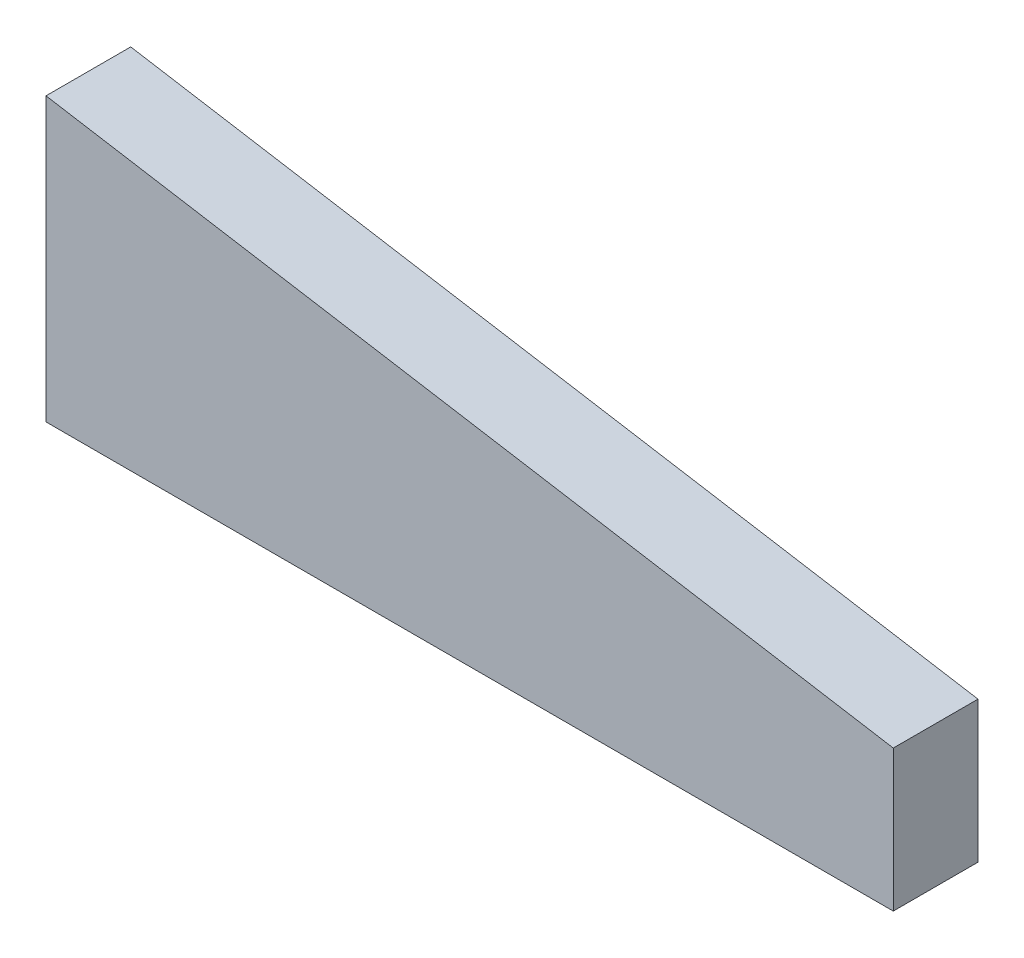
ISO-10303-21;
HEADER;
FILE_DESCRIPTION(('STEP AP214'),'2;1');
FILE_NAME('part.step','',(''),(''),'','','');
FILE_SCHEMA(('AUTOMOTIVE_DESIGN { 1 0 10303 214 1 1 1 1 }'));
ENDSEC;
DATA;
#1=APPLICATION_CONTEXT('core data for automotive mechanical design processes');
#2=APPLICATION_PROTOCOL_DEFINITION('international standard','automotive_design',2000,#1);
#3=PRODUCT_CONTEXT('',#1,'mechanical');
#4=PRODUCT('Part','Part','',(#3));
#5=PRODUCT_RELATED_PRODUCT_CATEGORY('part','',(#4));
#6=PRODUCT_DEFINITION_FORMATION('','',#4);
#7=PRODUCT_DEFINITION_CONTEXT('part definition',#1,'design');
#8=PRODUCT_DEFINITION('design','',#6,#7);
#9=PRODUCT_DEFINITION_SHAPE('','',#8);
#10=(LENGTH_UNIT() NAMED_UNIT(*) SI_UNIT(.MILLI.,.METRE.));
#11=(NAMED_UNIT(*) PLANE_ANGLE_UNIT() SI_UNIT($,.RADIAN.));
#12=(NAMED_UNIT(*) SI_UNIT($,.STERADIAN.) SOLID_ANGLE_UNIT());
#13=UNCERTAINTY_MEASURE_WITH_UNIT(LENGTH_MEASURE(1.E-05),#10,'distance_accuracy_value','');
#14=(GEOMETRIC_REPRESENTATION_CONTEXT(3) GLOBAL_UNCERTAINTY_ASSIGNED_CONTEXT((#13)) GLOBAL_UNIT_ASSIGNED_CONTEXT((#10,
#11,#12)) REPRESENTATION_CONTEXT('',''));
#15=CARTESIAN_POINT('',(0.,0.,0.));
#16=DIRECTION('',(0.,0.,1.));
#17=DIRECTION('',(1.,0.,0.));
#18=AXIS2_PLACEMENT_3D('',#15,#16,#17);
#19=CARTESIAN_POINT('',(-15.,-5.,3.));
#20=DIRECTION('',(1.,0.,0.));
#21=DIRECTION('',(0.,0.,-1.));
#22=AXIS2_PLACEMENT_3D('',#19,#20,#21);
#23=PLANE('',#22);
#24=DIRECTION('',(0.,-1.,0.));
#25=VECTOR('',#24,1.);
#26=CARTESIAN_POINT('',(-15.,-5.,0.));
#27=LINE('',#26,#25);
#28=CARTESIAN_POINT('',(-15.,5.,0.));
#29=VERTEX_POINT('',#28);
#30=CARTESIAN_POINT('',(-15.,-5.,0.));
#31=VERTEX_POINT('',#30);
#32=EDGE_CURVE('E96',#29,#31,#27,.T.);
#33=ORIENTED_EDGE('',*,*,#32,.T.);
#34=DIRECTION('',(0.,0.,-1.));
#35=VECTOR('',#34,1.);
#36=CARTESIAN_POINT('',(-15.,-5.,3.));
#37=LINE('',#36,#35);
#38=CARTESIAN_POINT('',(-15.,-5.,3.));
#39=VERTEX_POINT('',#38);
#40=EDGE_CURVE('E11',#39,#31,#37,.T.);
#41=ORIENTED_EDGE('',*,*,#40,.F.);
#42=DIRECTION('',(0.,-1.,0.));
#43=VECTOR('',#42,1.);
#44=CARTESIAN_POINT('',(-15.,-5.,3.));
#45=LINE('',#44,#43);
#46=CARTESIAN_POINT('',(-15.,5.,3.));
#47=VERTEX_POINT('',#46);
#48=EDGE_CURVE('E84',#47,#39,#45,.T.);
#49=ORIENTED_EDGE('',*,*,#48,.F.);
#50=DIRECTION('',(0.,0.,-1.));
#51=VECTOR('',#50,1.);
#52=CARTESIAN_POINT('',(-15.,5.,3.));
#53=LINE('',#52,#51);
#54=EDGE_CURVE('E92',#47,#29,#53,.T.);
#55=ORIENTED_EDGE('',*,*,#54,.T.);
#56=EDGE_LOOP('',(#33,#41,#49,#55));
#57=FACE_BOUND('',#56,.T.);
#58=ADVANCED_FACE('F33',(#57),#23,.F.);
#59=CARTESIAN_POINT('',(-15.,-5.,3.));
#60=DIRECTION('',(0.,1.,0.));
#61=DIRECTION('',(0.,0.,1.));
#62=AXIS2_PLACEMENT_3D('',#59,#60,#61);
#63=PLANE('',#62);
#64=DIRECTION('',(1.,0.,0.));
#65=VECTOR('',#64,1.);
#66=CARTESIAN_POINT('',(-15.,-5.,0.));
#67=LINE('',#66,#65);
#68=CARTESIAN_POINT('',(15.,-5.,0.));
#69=VERTEX_POINT('',#68);
#70=EDGE_CURVE('E88',#31,#69,#67,.T.);
#71=ORIENTED_EDGE('',*,*,#70,.T.);
#72=DIRECTION('',(0.,0.,-1.));
#73=VECTOR('',#72,1.);
#74=CARTESIAN_POINT('',(15.,-5.,3.));
#75=LINE('',#74,#73);
#76=CARTESIAN_POINT('',(15.,-5.,3.));
#77=VERTEX_POINT('',#76);
#78=EDGE_CURVE('E41',#77,#69,#75,.T.);
#79=ORIENTED_EDGE('',*,*,#78,.F.);
#80=DIRECTION('',(1.,0.,0.));
#81=VECTOR('',#80,1.);
#82=CARTESIAN_POINT('',(-15.,-5.,3.));
#83=LINE('',#82,#81);
#84=EDGE_CURVE('E79',#39,#77,#83,.T.);
#85=ORIENTED_EDGE('',*,*,#84,.F.);
#86=ORIENTED_EDGE('',*,*,#40,.T.);
#87=EDGE_LOOP('',(#71,#79,#85,#86));
#88=FACE_BOUND('',#87,.T.);
#89=ADVANCED_FACE('F87',(#88),#63,.F.);
#90=CARTESIAN_POINT('',(15.,-5.,3.));
#91=DIRECTION('',(-1.,0.,0.));
#92=DIRECTION('',(0.,0.,1.));
#93=AXIS2_PLACEMENT_3D('',#90,#91,#92);
#94=PLANE('',#93);
#95=DIRECTION('',(0.,1.,0.));
#96=VECTOR('',#95,1.);
#97=CARTESIAN_POINT('',(15.,-5.,0.));
#98=LINE('',#97,#96);
#99=CARTESIAN_POINT('',(15.,0.,0.));
#100=VERTEX_POINT('',#99);
#101=EDGE_CURVE('E66',#69,#100,#98,.T.);
#102=ORIENTED_EDGE('',*,*,#101,.T.);
#103=DIRECTION('',(0.,0.,-1.));
#104=VECTOR('',#103,1.);
#105=CARTESIAN_POINT('',(15.,0.,3.));
#106=LINE('',#105,#104);
#107=CARTESIAN_POINT('',(15.,0.,3.));
#108=VERTEX_POINT('',#107);
#109=EDGE_CURVE('E89',#108,#100,#106,.T.);
#110=ORIENTED_EDGE('',*,*,#109,.F.);
#111=DIRECTION('',(0.,1.,0.));
#112=VECTOR('',#111,1.);
#113=CARTESIAN_POINT('',(15.,-5.,3.));
#114=LINE('',#113,#112);
#115=EDGE_CURVE('E82',#77,#108,#114,.T.);
#116=ORIENTED_EDGE('',*,*,#115,.F.);
#117=ORIENTED_EDGE('',*,*,#78,.T.);
#118=EDGE_LOOP('',(#102,#110,#116,#117));
#119=FACE_BOUND('',#118,.T.);
#120=ADVANCED_FACE('F90',(#119),#94,.F.);
#121=CARTESIAN_POINT('',(15.,0.,3.));
#122=DIRECTION('',(-0.164398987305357,-0.986393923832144,0.));
#123=DIRECTION('',(0.986393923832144,-0.164398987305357,0.));
#124=AXIS2_PLACEMENT_3D('',#121,#122,#123);
#125=PLANE('',#124);
#126=DIRECTION('',(-0.986393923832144,0.164398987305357,0.));
#127=VECTOR('',#126,1.);
#128=CARTESIAN_POINT('',(15.,0.,0.));
#129=LINE('',#128,#127);
#130=EDGE_CURVE('E72',#100,#29,#129,.T.);
#131=ORIENTED_EDGE('',*,*,#130,.T.);
#132=ORIENTED_EDGE('',*,*,#54,.F.);
#133=DIRECTION('',(-0.986393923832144,0.164398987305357,0.));
#134=VECTOR('',#133,1.);
#135=CARTESIAN_POINT('',(15.,0.,3.));
#136=LINE('',#135,#134);
#137=EDGE_CURVE('E49',#108,#47,#136,.T.);
#138=ORIENTED_EDGE('',*,*,#137,.F.);
#139=ORIENTED_EDGE('',*,*,#109,.T.);
#140=EDGE_LOOP('',(#131,#132,#138,#139));
#141=FACE_BOUND('',#140,.T.);
#142=ADVANCED_FACE('F103',(#141),#125,.F.);
#143=CARTESIAN_POINT('',(0.,0.,3.));
#144=DIRECTION('',(0.,0.,-1.));
#145=DIRECTION('',(-1.,0.,0.));
#146=AXIS2_PLACEMENT_3D('',#143,#144,#145);
#147=PLANE('',#146);
#148=ORIENTED_EDGE('',*,*,#48,.T.);
#149=ORIENTED_EDGE('',*,*,#84,.T.);
#150=ORIENTED_EDGE('',*,*,#115,.T.);
#151=ORIENTED_EDGE('',*,*,#137,.T.);
#152=EDGE_LOOP('',(#148,#149,#150,#151));
#153=FACE_BOUND('',#152,.T.);
#154=ADVANCED_FACE('F80',(#153),#147,.F.);
#155=CARTESIAN_POINT('',(0.,0.,0.));
#156=DIRECTION('',(0.,0.,-1.));
#157=DIRECTION('',(-1.,0.,0.));
#158=AXIS2_PLACEMENT_3D('',#155,#156,#157);
#159=PLANE('',#158);
#160=ORIENTED_EDGE('',*,*,#32,.F.);
#161=ORIENTED_EDGE('',*,*,#130,.F.);
#162=ORIENTED_EDGE('',*,*,#101,.F.);
#163=ORIENTED_EDGE('',*,*,#70,.F.);
#164=EDGE_LOOP('',(#160,#161,#162,#163));
#165=FACE_BOUND('',#164,.T.);
#166=ADVANCED_FACE('F106',(#165),#159,.T.);
#167=CLOSED_SHELL('',(#58,#89,#120,#142,#154,#166));
#168=MANIFOLD_SOLID_BREP('B2',#167);
#169=ADVANCED_BREP_SHAPE_REPRESENTATION('',(#18,#168),#14);
#170=SHAPE_DEFINITION_REPRESENTATION(#9,#169);
ENDSEC;
END-ISO-10303-21;
